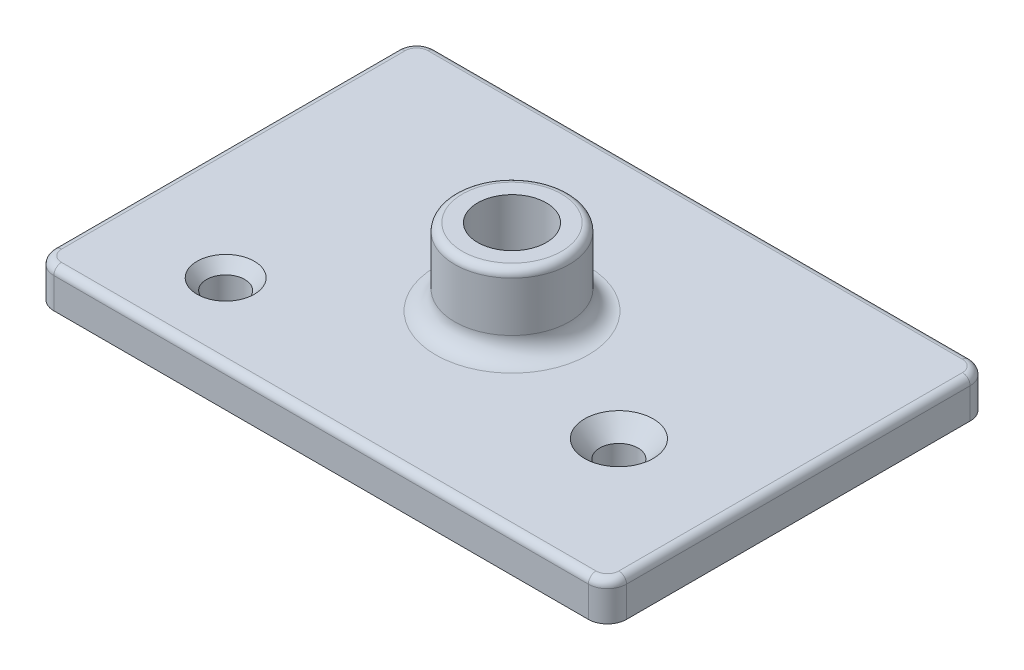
ISO-10303-21;
HEADER;
FILE_DESCRIPTION(('STEP AP214'),'2;1');
FILE_NAME('part.step','',(''),(''),'','','');
FILE_SCHEMA(('AUTOMOTIVE_DESIGN { 1 0 10303 214 1 1 1 1 }'));
ENDSEC;
DATA;
#1=APPLICATION_CONTEXT('core data for automotive mechanical design processes');
#2=APPLICATION_PROTOCOL_DEFINITION('international standard','automotive_design',2000,#1);
#3=PRODUCT_CONTEXT('',#1,'mechanical');
#4=PRODUCT('Part','Part','',(#3));
#5=PRODUCT_RELATED_PRODUCT_CATEGORY('part','',(#4));
#6=PRODUCT_DEFINITION_FORMATION('','',#4);
#7=PRODUCT_DEFINITION_CONTEXT('part definition',#1,'design');
#8=PRODUCT_DEFINITION('design','',#6,#7);
#9=PRODUCT_DEFINITION_SHAPE('','',#8);
#10=(LENGTH_UNIT() NAMED_UNIT(*) SI_UNIT(.MILLI.,.METRE.));
#11=(NAMED_UNIT(*) PLANE_ANGLE_UNIT() SI_UNIT($,.RADIAN.));
#12=(NAMED_UNIT(*) SI_UNIT($,.STERADIAN.) SOLID_ANGLE_UNIT());
#13=UNCERTAINTY_MEASURE_WITH_UNIT(LENGTH_MEASURE(1.E-05),#10,'distance_accuracy_value','');
#14=(GEOMETRIC_REPRESENTATION_CONTEXT(3) GLOBAL_UNCERTAINTY_ASSIGNED_CONTEXT((#13)) GLOBAL_UNIT_ASSIGNED_CONTEXT((#10,
#11,#12)) REPRESENTATION_CONTEXT('',''));
#15=CARTESIAN_POINT('',(0.,0.,0.));
#16=DIRECTION('',(0.,0.,1.));
#17=DIRECTION('',(1.,0.,0.));
#18=AXIS2_PLACEMENT_3D('',#15,#16,#17);
#19=CARTESIAN_POINT('',(-75.,10.,-50.));
#20=DIRECTION('',(0.,1.,0.));
#21=DIRECTION('',(0.,0.,1.));
#22=AXIS2_PLACEMENT_3D('',#19,#20,#21);
#23=PLANE('',#22);
#24=CARTESIAN_POINT('',(70.,10.,-45.));
#25=DIRECTION('',(0.,1.,0.));
#26=DIRECTION('',(0.,0.,1.));
#27=AXIS2_PLACEMENT_3D('',#24,#25,#26);
#28=CIRCLE('',#27,3.);
#29=CARTESIAN_POINT('',(73.,10.,-45.));
#30=VERTEX_POINT('',#29);
#31=CARTESIAN_POINT('',(70.,10.,-48.));
#32=VERTEX_POINT('',#31);
#33=EDGE_CURVE('E177',#30,#32,#28,.T.);
#34=ORIENTED_EDGE('',*,*,#33,.T.);
#35=DIRECTION('',(1.,0.,0.));
#36=VECTOR('',#35,1.);
#37=CARTESIAN_POINT('',(-75.,10.,-48.));
#38=LINE('',#37,#36);
#39=CARTESIAN_POINT('',(-70.,10.,-48.));
#40=VERTEX_POINT('',#39);
#41=EDGE_CURVE('E179',#32,#40,#38,.F.);
#42=ORIENTED_EDGE('',*,*,#41,.T.);
#43=CARTESIAN_POINT('',(-70.,10.,-45.));
#44=DIRECTION('',(0.,1.,0.));
#45=DIRECTION('',(0.,0.,1.));
#46=AXIS2_PLACEMENT_3D('',#43,#44,#45);
#47=CIRCLE('',#46,3.);
#48=CARTESIAN_POINT('',(-73.,10.,-45.));
#49=VERTEX_POINT('',#48);
#50=EDGE_CURVE('E175',#40,#49,#47,.T.);
#51=ORIENTED_EDGE('',*,*,#50,.T.);
#52=DIRECTION('',(0.,0.,1.));
#53=VECTOR('',#52,1.);
#54=CARTESIAN_POINT('',(-73.,10.,45.));
#55=LINE('',#54,#53);
#56=CARTESIAN_POINT('',(-73.,10.,45.));
#57=VERTEX_POINT('',#56);
#58=EDGE_CURVE('E171',#49,#57,#55,.T.);
#59=ORIENTED_EDGE('',*,*,#58,.T.);
#60=CARTESIAN_POINT('',(-70.,10.,45.));
#61=DIRECTION('',(0.,1.,0.));
#62=DIRECTION('',(0.,0.,1.));
#63=AXIS2_PLACEMENT_3D('',#60,#61,#62);
#64=CIRCLE('',#63,3.);
#65=CARTESIAN_POINT('',(-70.,10.,48.));
#66=VERTEX_POINT('',#65);
#67=EDGE_CURVE('E167',#57,#66,#64,.T.);
#68=ORIENTED_EDGE('',*,*,#67,.T.);
#69=DIRECTION('',(-1.,0.,0.));
#70=VECTOR('',#69,1.);
#71=CARTESIAN_POINT('',(-75.,10.,48.));
#72=LINE('',#71,#70);
#73=CARTESIAN_POINT('',(70.,10.,48.));
#74=VERTEX_POINT('',#73);
#75=EDGE_CURVE('E165',#66,#74,#72,.F.);
#76=ORIENTED_EDGE('',*,*,#75,.T.);
#77=CARTESIAN_POINT('',(70.,10.,45.));
#78=DIRECTION('',(0.,1.,0.));
#79=DIRECTION('',(0.,0.,1.));
#80=AXIS2_PLACEMENT_3D('',#77,#78,#79);
#81=CIRCLE('',#80,3.);
#82=CARTESIAN_POINT('',(73.,10.,45.));
#83=VERTEX_POINT('',#82);
#84=EDGE_CURVE('E169',#74,#83,#81,.T.);
#85=ORIENTED_EDGE('',*,*,#84,.T.);
#86=DIRECTION('',(0.,0.,-1.));
#87=VECTOR('',#86,1.);
#88=CARTESIAN_POINT('',(73.,10.,-45.));
#89=LINE('',#88,#87);
#90=EDGE_CURVE('E173',#83,#30,#89,.T.);
#91=ORIENTED_EDGE('',*,*,#90,.T.);
#92=EDGE_LOOP('',(#34,#42,#51,#59,#68,#76,#85,#91));
#93=FACE_BOUND('',#92,.T.);
#94=CARTESIAN_POINT('',(0.,10.,0.));
#95=DIRECTION('',(0.,1.,0.));
#96=DIRECTION('',(0.,0.,1.));
#97=AXIS2_PLACEMENT_3D('',#94,#95,#96);
#98=CIRCLE('',#97,20.);
#99=CARTESIAN_POINT('',(0.,10.,20.));
#100=VERTEX_POINT('',#99);
#101=EDGE_CURVE('E134',#100,#100,#98,.F.);
#102=ORIENTED_EDGE('',*,*,#101,.T.);
#103=EDGE_LOOP('',(#102));
#104=FACE_BOUND('',#103,.T.);
#105=CARTESIAN_POINT('',(-45.,10.,30.));
#106=DIRECTION('',(0.,1.,0.));
#107=DIRECTION('',(0.,0.,1.));
#108=AXIS2_PLACEMENT_3D('',#105,#106,#107);
#109=CIRCLE('',#108,7.5);
#110=CARTESIAN_POINT('',(-45.,10.,37.5));
#111=VERTEX_POINT('',#110);
#112=EDGE_CURVE('E332',#111,#111,#109,.T.);
#113=ORIENTED_EDGE('',*,*,#112,.F.);
#114=EDGE_LOOP('',(#113));
#115=FACE_BOUND('',#114,.T.);
#116=CARTESIAN_POINT('',(43.,9.99999999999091,15.));
#117=DIRECTION('',(0.,1.,0.));
#118=DIRECTION('',(0.,0.,1.));
#119=AXIS2_PLACEMENT_3D('',#116,#117,#118);
#120=CIRCLE('',#119,9.);
#121=CARTESIAN_POINT('',(43.,9.99999999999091,24.));
#122=VERTEX_POINT('',#121);
#123=EDGE_CURVE('E320',#122,#122,#120,.T.);
#124=ORIENTED_EDGE('',*,*,#123,.F.);
#125=EDGE_LOOP('',(#124));
#126=FACE_BOUND('',#125,.T.);
#127=ADVANCED_FACE('F28',(#93,#104,#115,#126),#23,.T.);
#128=CARTESIAN_POINT('',(-75.,0.,-50.));
#129=DIRECTION('',(0.,1.,0.));
#130=DIRECTION('',(0.,0.,1.));
#131=AXIS2_PLACEMENT_3D('',#128,#129,#130);
#132=PLANE('',#131);
#133=CARTESIAN_POINT('',(-45.,0.,30.));
#134=DIRECTION('',(0.,1.,0.));
#135=DIRECTION('',(0.,0.,1.));
#136=AXIS2_PLACEMENT_3D('',#133,#134,#135);
#137=CIRCLE('',#136,5.);
#138=CARTESIAN_POINT('',(-45.,0.,35.));
#139=VERTEX_POINT('',#138);
#140=EDGE_CURVE('E218',#139,#139,#137,.T.);
#141=ORIENTED_EDGE('',*,*,#140,.T.);
#142=EDGE_LOOP('',(#141));
#143=FACE_BOUND('',#142,.T.);
#144=DIRECTION('',(-1.,0.,0.));
#145=VECTOR('',#144,1.);
#146=CARTESIAN_POINT('',(75.,0.,50.));
#147=LINE('',#146,#145);
#148=CARTESIAN_POINT('',(70.,0.,50.));
#149=VERTEX_POINT('',#148);
#150=CARTESIAN_POINT('',(-70.,0.,50.));
#151=VERTEX_POINT('',#150);
#152=EDGE_CURVE('E122',#149,#151,#147,.T.);
#153=ORIENTED_EDGE('',*,*,#152,.T.);
#154=CARTESIAN_POINT('',(-70.,0.,45.));
#155=DIRECTION('',(0.,1.,0.));
#156=DIRECTION('',(0.,0.,1.));
#157=AXIS2_PLACEMENT_3D('',#154,#155,#156);
#158=CIRCLE('',#157,5.);
#159=CARTESIAN_POINT('',(-75.,0.,45.));
#160=VERTEX_POINT('',#159);
#161=EDGE_CURVE('E145',#151,#160,#158,.F.);
#162=ORIENTED_EDGE('',*,*,#161,.T.);
#163=DIRECTION('',(0.,0.,1.));
#164=VECTOR('',#163,1.);
#165=CARTESIAN_POINT('',(-75.,0.,-50.));
#166=LINE('',#165,#164);
#167=CARTESIAN_POINT('',(-75.,0.,-45.));
#168=VERTEX_POINT('',#167);
#169=EDGE_CURVE('E131',#168,#160,#166,.T.);
#170=ORIENTED_EDGE('',*,*,#169,.F.);
#171=CARTESIAN_POINT('',(-70.,0.,-45.));
#172=DIRECTION('',(0.,1.,0.));
#173=DIRECTION('',(0.,0.,1.));
#174=AXIS2_PLACEMENT_3D('',#171,#172,#173);
#175=CIRCLE('',#174,5.);
#176=CARTESIAN_POINT('',(-70.,0.,-50.));
#177=VERTEX_POINT('',#176);
#178=EDGE_CURVE('E143',#168,#177,#175,.F.);
#179=ORIENTED_EDGE('',*,*,#178,.T.);
#180=DIRECTION('',(1.,0.,0.));
#181=VECTOR('',#180,1.);
#182=CARTESIAN_POINT('',(-75.,0.,-50.));
#183=LINE('',#182,#181);
#184=CARTESIAN_POINT('',(70.,0.,-50.));
#185=VERTEX_POINT('',#184);
#186=EDGE_CURVE('E230',#177,#185,#183,.T.);
#187=ORIENTED_EDGE('',*,*,#186,.T.);
#188=CARTESIAN_POINT('',(70.,0.,-45.));
#189=DIRECTION('',(0.,1.,0.));
#190=DIRECTION('',(0.,0.,1.));
#191=AXIS2_PLACEMENT_3D('',#188,#189,#190);
#192=CIRCLE('',#191,5.);
#193=CARTESIAN_POINT('',(75.,0.,-45.));
#194=VERTEX_POINT('',#193);
#195=EDGE_CURVE('E125',#185,#194,#192,.F.);
#196=ORIENTED_EDGE('',*,*,#195,.T.);
#197=DIRECTION('',(0.,0.,-1.));
#198=VECTOR('',#197,1.);
#199=CARTESIAN_POINT('',(75.,0.,50.));
#200=LINE('',#199,#198);
#201=CARTESIAN_POINT('',(75.,0.,45.));
#202=VERTEX_POINT('',#201);
#203=EDGE_CURVE('E124',#202,#194,#200,.T.);
#204=ORIENTED_EDGE('',*,*,#203,.F.);
#205=CARTESIAN_POINT('',(70.,0.,45.));
#206=DIRECTION('',(0.,1.,0.));
#207=DIRECTION('',(0.,0.,1.));
#208=AXIS2_PLACEMENT_3D('',#205,#206,#207);
#209=CIRCLE('',#208,5.);
#210=EDGE_CURVE('E118',#202,#149,#209,.F.);
#211=ORIENTED_EDGE('',*,*,#210,.T.);
#212=EDGE_LOOP('',(#153,#162,#170,#179,#187,#196,#204,#211));
#213=FACE_BOUND('',#212,.T.);
#214=CARTESIAN_POINT('',(43.,0.,15.));
#215=DIRECTION('',(0.,1.,0.));
#216=DIRECTION('',(0.,0.,1.));
#217=AXIS2_PLACEMENT_3D('',#214,#215,#216);
#218=CIRCLE('',#217,5.);
#219=CARTESIAN_POINT('',(43.,0.,20.));
#220=VERTEX_POINT('',#219);
#221=EDGE_CURVE('E329',#220,#220,#218,.T.);
#222=ORIENTED_EDGE('',*,*,#221,.T.);
#223=EDGE_LOOP('',(#222));
#224=FACE_BOUND('',#223,.T.);
#225=ADVANCED_FACE('F120',(#143,#213,#224),#132,.F.);
#226=CARTESIAN_POINT('',(-75.,10.,-50.));
#227=DIRECTION('',(1.,0.,0.));
#228=DIRECTION('',(0.,0.,-1.));
#229=AXIS2_PLACEMENT_3D('',#226,#227,#228);
#230=PLANE('',#229);
#231=DIRECTION('',(0.,-1.,0.));
#232=VECTOR('',#231,1.);
#233=CARTESIAN_POINT('',(-75.,10.,45.));
#234=LINE('',#233,#232);
#235=CARTESIAN_POINT('',(-75.,8.,45.));
#236=VERTEX_POINT('',#235);
#237=EDGE_CURVE('E149',#160,#236,#234,.F.);
#238=ORIENTED_EDGE('',*,*,#237,.T.);
#239=DIRECTION('',(0.,0.,1.));
#240=VECTOR('',#239,1.);
#241=CARTESIAN_POINT('',(-75.,8.,-45.));
#242=LINE('',#241,#240);
#243=CARTESIAN_POINT('',(-75.,8.,-45.));
#244=VERTEX_POINT('',#243);
#245=EDGE_CURVE('E188',#236,#244,#242,.F.);
#246=ORIENTED_EDGE('',*,*,#245,.T.);
#247=DIRECTION('',(0.,-1.,0.));
#248=VECTOR('',#247,1.);
#249=CARTESIAN_POINT('',(-75.,0.,-45.));
#250=LINE('',#249,#248);
#251=EDGE_CURVE('E147',#244,#168,#250,.T.);
#252=ORIENTED_EDGE('',*,*,#251,.T.);
#253=ORIENTED_EDGE('',*,*,#169,.T.);
#254=EDGE_LOOP('',(#238,#246,#252,#253));
#255=FACE_BOUND('',#254,.T.);
#256=ADVANCED_FACE('F30',(#255),#230,.F.);
#257=CARTESIAN_POINT('',(75.,10.,50.));
#258=DIRECTION('',(0.,0.,1.));
#259=DIRECTION('',(1.,0.,0.));
#260=AXIS2_PLACEMENT_3D('',#257,#258,#259);
#261=PLANE('',#260);
#262=DIRECTION('',(0.,-1.,0.));
#263=VECTOR('',#262,1.);
#264=CARTESIAN_POINT('',(70.,10.,50.));
#265=LINE('',#264,#263);
#266=CARTESIAN_POINT('',(70.,8.,50.));
#267=VERTEX_POINT('',#266);
#268=EDGE_CURVE('E129',#149,#267,#265,.F.);
#269=ORIENTED_EDGE('',*,*,#268,.T.);
#270=DIRECTION('',(-1.,0.,0.));
#271=VECTOR('',#270,1.);
#272=CARTESIAN_POINT('',(75.,8.,50.));
#273=LINE('',#272,#271);
#274=CARTESIAN_POINT('',(-70.,8.,50.));
#275=VERTEX_POINT('',#274);
#276=EDGE_CURVE('E11',#267,#275,#273,.T.);
#277=ORIENTED_EDGE('',*,*,#276,.T.);
#278=DIRECTION('',(0.,-1.,0.));
#279=VECTOR('',#278,1.);
#280=CARTESIAN_POINT('',(-70.,0.,50.));
#281=LINE('',#280,#279);
#282=EDGE_CURVE('E126',#275,#151,#281,.T.);
#283=ORIENTED_EDGE('',*,*,#282,.T.);
#284=ORIENTED_EDGE('',*,*,#152,.F.);
#285=EDGE_LOOP('',(#269,#277,#283,#284));
#286=FACE_BOUND('',#285,.T.);
#287=ADVANCED_FACE('F128',(#286),#261,.T.);
#288=CARTESIAN_POINT('',(75.,10.,50.));
#289=DIRECTION('',(-1.,0.,0.));
#290=DIRECTION('',(0.,0.,1.));
#291=AXIS2_PLACEMENT_3D('',#288,#289,#290);
#292=PLANE('',#291);
#293=DIRECTION('',(0.,-1.,0.));
#294=VECTOR('',#293,1.);
#295=CARTESIAN_POINT('',(75.,10.,-45.));
#296=LINE('',#295,#294);
#297=CARTESIAN_POINT('',(75.,8.,-45.));
#298=VERTEX_POINT('',#297);
#299=EDGE_CURVE('E159',#194,#298,#296,.F.);
#300=ORIENTED_EDGE('',*,*,#299,.T.);
#301=DIRECTION('',(0.,0.,-1.));
#302=VECTOR('',#301,1.);
#303=CARTESIAN_POINT('',(75.,8.,45.));
#304=LINE('',#303,#302);
#305=CARTESIAN_POINT('',(75.,8.,45.));
#306=VERTEX_POINT('',#305);
#307=EDGE_CURVE('E186',#298,#306,#304,.F.);
#308=ORIENTED_EDGE('',*,*,#307,.T.);
#309=DIRECTION('',(0.,-1.,0.));
#310=VECTOR('',#309,1.);
#311=CARTESIAN_POINT('',(75.,0.,45.));
#312=LINE('',#311,#310);
#313=EDGE_CURVE('E157',#306,#202,#312,.T.);
#314=ORIENTED_EDGE('',*,*,#313,.T.);
#315=ORIENTED_EDGE('',*,*,#203,.T.);
#316=EDGE_LOOP('',(#300,#308,#314,#315));
#317=FACE_BOUND('',#316,.T.);
#318=ADVANCED_FACE('F267',(#317),#292,.F.);
#319=CARTESIAN_POINT('',(-75.,10.,-50.));
#320=DIRECTION('',(0.,0.,-1.));
#321=DIRECTION('',(-1.,0.,0.));
#322=AXIS2_PLACEMENT_3D('',#319,#320,#321);
#323=PLANE('',#322);
#324=DIRECTION('',(0.,-1.,0.));
#325=VECTOR('',#324,1.);
#326=CARTESIAN_POINT('',(-70.,10.,-50.));
#327=LINE('',#326,#325);
#328=CARTESIAN_POINT('',(-70.,8.,-50.));
#329=VERTEX_POINT('',#328);
#330=EDGE_CURVE('E154',#177,#329,#327,.F.);
#331=ORIENTED_EDGE('',*,*,#330,.T.);
#332=DIRECTION('',(1.,0.,0.));
#333=VECTOR('',#332,1.);
#334=CARTESIAN_POINT('',(-75.,8.,-50.));
#335=LINE('',#334,#333);
#336=CARTESIAN_POINT('',(70.,8.,-50.));
#337=VERTEX_POINT('',#336);
#338=EDGE_CURVE('E162',#329,#337,#335,.T.);
#339=ORIENTED_EDGE('',*,*,#338,.T.);
#340=DIRECTION('',(0.,-1.,0.));
#341=VECTOR('',#340,1.);
#342=CARTESIAN_POINT('',(70.,0.,-50.));
#343=LINE('',#342,#341);
#344=EDGE_CURVE('E152',#337,#185,#343,.T.);
#345=ORIENTED_EDGE('',*,*,#344,.T.);
#346=ORIENTED_EDGE('',*,*,#186,.F.);
#347=EDGE_LOOP('',(#331,#339,#345,#346));
#348=FACE_BOUND('',#347,.T.);
#349=ADVANCED_FACE('F264',(#348),#323,.T.);
#350=CARTESIAN_POINT('',(0.,30.,0.));
#351=DIRECTION('',(0.,-1.,0.));
#352=DIRECTION('',(0.,0.,-1.));
#353=AXIS2_PLACEMENT_3D('',#350,#351,#352);
#354=CYLINDRICAL_SURFACE('',#353,15.);
#355=CARTESIAN_POINT('',(0.,28.,0.));
#356=DIRECTION('',(0.,1.,0.));
#357=DIRECTION('',(0.,0.,1.));
#358=AXIS2_PLACEMENT_3D('',#355,#356,#357);
#359=CIRCLE('',#358,15.);
#360=CARTESIAN_POINT('',(0.,28.,15.));
#361=VERTEX_POINT('',#360);
#362=EDGE_CURVE('E36',#361,#361,#359,.F.);
#363=ORIENTED_EDGE('',*,*,#362,.T.);
#364=EDGE_LOOP('',(#363));
#365=FACE_BOUND('',#364,.T.);
#366=CARTESIAN_POINT('',(0.,15.,0.));
#367=DIRECTION('',(0.,1.,0.));
#368=DIRECTION('',(0.,0.,1.));
#369=AXIS2_PLACEMENT_3D('',#366,#367,#368);
#370=CIRCLE('',#369,15.);
#371=CARTESIAN_POINT('',(0.,15.,15.));
#372=VERTEX_POINT('',#371);
#373=EDGE_CURVE('E138',#372,#372,#370,.T.);
#374=ORIENTED_EDGE('',*,*,#373,.T.);
#375=EDGE_LOOP('',(#374));
#376=FACE_BOUND('',#375,.T.);
#377=ADVANCED_FACE('F198',(#365,#376),#354,.T.);
#378=CARTESIAN_POINT('',(0.,30.,0.));
#379=DIRECTION('',(0.,1.,0.));
#380=DIRECTION('',(0.,0.,1.));
#381=AXIS2_PLACEMENT_3D('',#378,#379,#380);
#382=PLANE('',#381);
#383=CARTESIAN_POINT('',(0.,30.,0.));
#384=DIRECTION('',(0.,1.,0.));
#385=DIRECTION('',(0.,0.,1.));
#386=AXIS2_PLACEMENT_3D('',#383,#384,#385);
#387=CIRCLE('',#386,13.);
#388=CARTESIAN_POINT('',(0.,30.,13.));
#389=VERTEX_POINT('',#388);
#390=EDGE_CURVE('E193',#389,#389,#387,.T.);
#391=ORIENTED_EDGE('',*,*,#390,.T.);
#392=EDGE_LOOP('',(#391));
#393=FACE_BOUND('',#392,.T.);
#394=CARTESIAN_POINT('',(0.,30.,0.));
#395=DIRECTION('',(0.,1.,0.));
#396=DIRECTION('',(0.,0.,1.));
#397=AXIS2_PLACEMENT_3D('',#394,#395,#396);
#398=CIRCLE('',#397,9.);
#399=CARTESIAN_POINT('',(0.,30.,9.));
#400=VERTEX_POINT('',#399);
#401=EDGE_CURVE('E215',#400,#400,#398,.T.);
#402=ORIENTED_EDGE('',*,*,#401,.F.);
#403=EDGE_LOOP('',(#402));
#404=FACE_BOUND('',#403,.T.);
#405=ADVANCED_FACE('F208',(#393,#404),#382,.T.);
#406=CARTESIAN_POINT('',(0.,5.,0.));
#407=DIRECTION('',(0.,1.,0.));
#408=DIRECTION('',(0.,0.,1.));
#409=AXIS2_PLACEMENT_3D('',#406,#407,#408);
#410=CYLINDRICAL_SURFACE('',#409,9.);
#411=CARTESIAN_POINT('',(0.,5.,0.));
#412=DIRECTION('',(0.,1.,0.));
#413=DIRECTION('',(0.,0.,1.));
#414=AXIS2_PLACEMENT_3D('',#411,#412,#413);
#415=CIRCLE('',#414,9.);
#416=CARTESIAN_POINT('',(0.,5.,9.));
#417=VERTEX_POINT('',#416);
#418=EDGE_CURVE('E217',#417,#417,#415,.T.);
#419=ORIENTED_EDGE('',*,*,#418,.F.);
#420=EDGE_LOOP('',(#419));
#421=FACE_BOUND('',#420,.T.);
#422=ORIENTED_EDGE('',*,*,#401,.T.);
#423=EDGE_LOOP('',(#422));
#424=FACE_BOUND('',#423,.T.);
#425=ADVANCED_FACE('F211',(#421,#424),#410,.F.);
#426=CARTESIAN_POINT('',(0.,5.,0.));
#427=DIRECTION('',(0.,1.,0.));
#428=DIRECTION('',(0.,0.,1.));
#429=AXIS2_PLACEMENT_3D('',#426,#427,#428);
#430=PLANE('',#429);
#431=ORIENTED_EDGE('',*,*,#418,.T.);
#432=EDGE_LOOP('',(#431));
#433=FACE_BOUND('',#432,.T.);
#434=ADVANCED_FACE('F350',(#433),#430,.T.);
#435=CARTESIAN_POINT('',(-45.,10.,30.));
#436=DIRECTION('',(0.,1.,0.));
#437=DIRECTION('',(0.,0.,1.));
#438=AXIS2_PLACEMENT_3D('',#435,#436,#437);
#439=CYLINDRICAL_SURFACE('',#438,5.);
#440=CARTESIAN_POINT('',(-45.,7.12407898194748,30.));
#441=DIRECTION('',(0.,1.,0.));
#442=DIRECTION('',(0.,0.,1.));
#443=AXIS2_PLACEMENT_3D('',#440,#441,#442);
#444=CIRCLE('',#443,5.);
#445=CARTESIAN_POINT('',(-45.,7.12407898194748,35.));
#446=VERTEX_POINT('',#445);
#447=EDGE_CURVE('E223',#446,#446,#444,.T.);
#448=ORIENTED_EDGE('',*,*,#447,.T.);
#449=EDGE_LOOP('',(#448));
#450=FACE_BOUND('',#449,.T.);
#451=ORIENTED_EDGE('',*,*,#140,.F.);
#452=EDGE_LOOP('',(#451));
#453=FACE_BOUND('',#452,.T.);
#454=ADVANCED_FACE('F337',(#450,#453),#439,.F.);
#455=CARTESIAN_POINT('',(-45.,7.12407898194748,30.));
#456=DIRECTION('',(0.,1.,0.));
#457=DIRECTION('',(0.,0.,1.));
#458=AXIS2_PLACEMENT_3D('',#455,#456,#457);
#459=CONICAL_SURFACE('',#458,5.,0.715584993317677);
#460=ORIENTED_EDGE('',*,*,#112,.T.);
#461=EDGE_LOOP('',(#460));
#462=FACE_BOUND('',#461,.T.);
#463=ORIENTED_EDGE('',*,*,#447,.F.);
#464=EDGE_LOOP('',(#463));
#465=FACE_BOUND('',#464,.T.);
#466=ADVANCED_FACE('F340',(#462,#465),#459,.F.);
#467=CARTESIAN_POINT('',(43.,9.99999999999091,15.));
#468=DIRECTION('',(0.,1.,0.));
#469=DIRECTION('',(0.,0.,1.));
#470=AXIS2_PLACEMENT_3D('',#467,#468,#469);
#471=CYLINDRICAL_SURFACE('',#470,5.);
#472=CARTESIAN_POINT('',(43.,5.39852637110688,15.));
#473=DIRECTION('',(0.,1.,0.));
#474=DIRECTION('',(0.,0.,1.));
#475=AXIS2_PLACEMENT_3D('',#472,#473,#474);
#476=CIRCLE('',#475,5.);
#477=CARTESIAN_POINT('',(43.,5.39852637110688,20.));
#478=VERTEX_POINT('',#477);
#479=EDGE_CURVE('E323',#478,#478,#476,.T.);
#480=ORIENTED_EDGE('',*,*,#479,.T.);
#481=EDGE_LOOP('',(#480));
#482=FACE_BOUND('',#481,.T.);
#483=ORIENTED_EDGE('',*,*,#221,.F.);
#484=EDGE_LOOP('',(#483));
#485=FACE_BOUND('',#484,.T.);
#486=ADVANCED_FACE('F250',(#482,#485),#471,.F.);
#487=CARTESIAN_POINT('',(43.,5.39852637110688,15.));
#488=DIRECTION('',(0.,1.,0.));
#489=DIRECTION('',(0.,0.,1.));
#490=AXIS2_PLACEMENT_3D('',#487,#488,#489);
#491=CONICAL_SURFACE('',#490,5.,0.715584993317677);
#492=ORIENTED_EDGE('',*,*,#123,.T.);
#493=EDGE_LOOP('',(#492));
#494=FACE_BOUND('',#493,.T.);
#495=ORIENTED_EDGE('',*,*,#479,.F.);
#496=EDGE_LOOP('',(#495));
#497=FACE_BOUND('',#496,.T.);
#498=ADVANCED_FACE('F238',(#494,#497),#491,.F.);
#499=CARTESIAN_POINT('',(0.,15.,0.));
#500=DIRECTION('',(0.,1.,0.));
#501=DIRECTION('',(0.,0.,1.));
#502=AXIS2_PLACEMENT_3D('',#499,#500,#501);
#503=TOROIDAL_SURFACE('',#502,20.,5.);
#504=ORIENTED_EDGE('',*,*,#101,.F.);
#505=EDGE_LOOP('',(#504));
#506=FACE_BOUND('',#505,.T.);
#507=ORIENTED_EDGE('',*,*,#373,.F.);
#508=EDGE_LOOP('',(#507));
#509=FACE_BOUND('',#508,.T.);
#510=ADVANCED_FACE('F235',(#506,#509),#503,.F.);
#511=CARTESIAN_POINT('',(-70.,10.,45.));
#512=DIRECTION('',(0.,1.,0.));
#513=DIRECTION('',(0.,0.,1.));
#514=AXIS2_PLACEMENT_3D('',#511,#512,#513);
#515=CYLINDRICAL_SURFACE('',#514,5.);
#516=ORIENTED_EDGE('',*,*,#282,.F.);
#517=CARTESIAN_POINT('',(-70.,8.,45.));
#518=DIRECTION('',(0.,1.,0.));
#519=DIRECTION('',(0.,0.,1.));
#520=AXIS2_PLACEMENT_3D('',#517,#518,#519);
#521=CIRCLE('',#520,5.);
#522=EDGE_CURVE('E191',#275,#236,#521,.F.);
#523=ORIENTED_EDGE('',*,*,#522,.T.);
#524=ORIENTED_EDGE('',*,*,#237,.F.);
#525=ORIENTED_EDGE('',*,*,#161,.F.);
#526=EDGE_LOOP('',(#516,#523,#524,#525));
#527=FACE_BOUND('',#526,.T.);
#528=ADVANCED_FACE('F237',(#527),#515,.T.);
#529=CARTESIAN_POINT('',(-70.,10.,-45.));
#530=DIRECTION('',(0.,1.,0.));
#531=DIRECTION('',(0.,0.,1.));
#532=AXIS2_PLACEMENT_3D('',#529,#530,#531);
#533=CYLINDRICAL_SURFACE('',#532,5.);
#534=ORIENTED_EDGE('',*,*,#251,.F.);
#535=CARTESIAN_POINT('',(-70.,8.,-45.));
#536=DIRECTION('',(0.,1.,0.));
#537=DIRECTION('',(0.,0.,1.));
#538=AXIS2_PLACEMENT_3D('',#535,#536,#537);
#539=CIRCLE('',#538,5.);
#540=EDGE_CURVE('E184',#244,#329,#539,.F.);
#541=ORIENTED_EDGE('',*,*,#540,.T.);
#542=ORIENTED_EDGE('',*,*,#330,.F.);
#543=ORIENTED_EDGE('',*,*,#178,.F.);
#544=EDGE_LOOP('',(#534,#541,#542,#543));
#545=FACE_BOUND('',#544,.T.);
#546=ADVANCED_FACE('F246',(#545),#533,.T.);
#547=CARTESIAN_POINT('',(70.,10.,-45.));
#548=DIRECTION('',(0.,1.,0.));
#549=DIRECTION('',(0.,0.,1.));
#550=AXIS2_PLACEMENT_3D('',#547,#548,#549);
#551=CYLINDRICAL_SURFACE('',#550,5.);
#552=ORIENTED_EDGE('',*,*,#344,.F.);
#553=CARTESIAN_POINT('',(70.,8.,-45.));
#554=DIRECTION('',(0.,1.,0.));
#555=DIRECTION('',(0.,0.,1.));
#556=AXIS2_PLACEMENT_3D('',#553,#554,#555);
#557=CIRCLE('',#556,5.);
#558=EDGE_CURVE('E182',#337,#298,#557,.F.);
#559=ORIENTED_EDGE('',*,*,#558,.T.);
#560=ORIENTED_EDGE('',*,*,#299,.F.);
#561=ORIENTED_EDGE('',*,*,#195,.F.);
#562=EDGE_LOOP('',(#552,#559,#560,#561));
#563=FACE_BOUND('',#562,.T.);
#564=ADVANCED_FACE('F378',(#563),#551,.T.);
#565=CARTESIAN_POINT('',(70.,10.,45.));
#566=DIRECTION('',(0.,1.,0.));
#567=DIRECTION('',(0.,0.,1.));
#568=AXIS2_PLACEMENT_3D('',#565,#566,#567);
#569=CYLINDRICAL_SURFACE('',#568,5.);
#570=ORIENTED_EDGE('',*,*,#313,.F.);
#571=CARTESIAN_POINT('',(70.,8.,45.));
#572=DIRECTION('',(0.,1.,0.));
#573=DIRECTION('',(0.,0.,1.));
#574=AXIS2_PLACEMENT_3D('',#571,#572,#573);
#575=CIRCLE('',#574,5.);
#576=EDGE_CURVE('E49',#306,#267,#575,.F.);
#577=ORIENTED_EDGE('',*,*,#576,.T.);
#578=ORIENTED_EDGE('',*,*,#268,.F.);
#579=ORIENTED_EDGE('',*,*,#210,.F.);
#580=EDGE_LOOP('',(#570,#577,#578,#579));
#581=FACE_BOUND('',#580,.T.);
#582=ADVANCED_FACE('F133',(#581),#569,.T.);
#583=CARTESIAN_POINT('',(75.,8.,48.));
#584=DIRECTION('',(-1.,0.,0.));
#585=DIRECTION('',(0.,0.,1.));
#586=AXIS2_PLACEMENT_3D('',#583,#584,#585);
#587=CYLINDRICAL_SURFACE('',#586,2.);
#588=CARTESIAN_POINT('',(70.,8.,48.));
#589=DIRECTION('',(1.,0.,0.));
#590=DIRECTION('',(0.,0.,-1.));
#591=AXIS2_PLACEMENT_3D('',#588,#589,#590);
#592=CIRCLE('',#591,2.);
#593=EDGE_CURVE('E291',#74,#267,#592,.T.);
#594=ORIENTED_EDGE('',*,*,#593,.F.);
#595=ORIENTED_EDGE('',*,*,#75,.F.);
#596=CARTESIAN_POINT('',(-70.,8.,48.));
#597=DIRECTION('',(-1.,0.,0.));
#598=DIRECTION('',(0.,0.,1.));
#599=AXIS2_PLACEMENT_3D('',#596,#597,#598);
#600=CIRCLE('',#599,2.);
#601=EDGE_CURVE('E316',#275,#66,#600,.T.);
#602=ORIENTED_EDGE('',*,*,#601,.F.);
#603=ORIENTED_EDGE('',*,*,#276,.F.);
#604=EDGE_LOOP('',(#594,#595,#602,#603));
#605=FACE_BOUND('',#604,.T.);
#606=ADVANCED_FACE('F318',(#605),#587,.T.);
#607=CARTESIAN_POINT('',(-70.,8.,45.));
#608=DIRECTION('',(0.,1.,0.));
#609=DIRECTION('',(0.,0.,1.));
#610=AXIS2_PLACEMENT_3D('',#607,#608,#609);
#611=TOROIDAL_SURFACE('',#610,3.,2.);
#612=ORIENTED_EDGE('',*,*,#601,.T.);
#613=ORIENTED_EDGE('',*,*,#67,.F.);
#614=CARTESIAN_POINT('',(-73.,8.,45.));
#615=DIRECTION('',(0.,0.,-1.));
#616=DIRECTION('',(-1.,0.,0.));
#617=AXIS2_PLACEMENT_3D('',#614,#615,#616);
#618=CIRCLE('',#617,2.);
#619=EDGE_CURVE('E286',#236,#57,#618,.T.);
#620=ORIENTED_EDGE('',*,*,#619,.F.);
#621=ORIENTED_EDGE('',*,*,#522,.F.);
#622=EDGE_LOOP('',(#612,#613,#620,#621));
#623=FACE_BOUND('',#622,.T.);
#624=ADVANCED_FACE('F288',(#623),#611,.T.);
#625=CARTESIAN_POINT('',(70.,8.,45.));
#626=DIRECTION('',(0.,1.,0.));
#627=DIRECTION('',(0.,0.,1.));
#628=AXIS2_PLACEMENT_3D('',#625,#626,#627);
#629=TOROIDAL_SURFACE('',#628,3.,2.);
#630=ORIENTED_EDGE('',*,*,#593,.T.);
#631=ORIENTED_EDGE('',*,*,#576,.F.);
#632=CARTESIAN_POINT('',(73.,8.,45.));
#633=DIRECTION('',(0.,0.,-1.));
#634=DIRECTION('',(-1.,0.,0.));
#635=AXIS2_PLACEMENT_3D('',#632,#633,#634);
#636=CIRCLE('',#635,2.);
#637=EDGE_CURVE('E292',#83,#306,#636,.T.);
#638=ORIENTED_EDGE('',*,*,#637,.F.);
#639=ORIENTED_EDGE('',*,*,#84,.F.);
#640=EDGE_LOOP('',(#630,#631,#638,#639));
#641=FACE_BOUND('',#640,.T.);
#642=ADVANCED_FACE('F404',(#641),#629,.T.);
#643=CARTESIAN_POINT('',(-73.,8.,-50.));
#644=DIRECTION('',(0.,0.,-1.));
#645=DIRECTION('',(-1.,0.,0.));
#646=AXIS2_PLACEMENT_3D('',#643,#644,#645);
#647=CYLINDRICAL_SURFACE('',#646,2.);
#648=ORIENTED_EDGE('',*,*,#619,.T.);
#649=ORIENTED_EDGE('',*,*,#58,.F.);
#650=CARTESIAN_POINT('',(-73.,8.,-45.));
#651=DIRECTION('',(0.,0.,-1.));
#652=DIRECTION('',(-1.,0.,0.));
#653=AXIS2_PLACEMENT_3D('',#650,#651,#652);
#654=CIRCLE('',#653,2.);
#655=EDGE_CURVE('E297',#244,#49,#654,.T.);
#656=ORIENTED_EDGE('',*,*,#655,.F.);
#657=ORIENTED_EDGE('',*,*,#245,.F.);
#658=EDGE_LOOP('',(#648,#649,#656,#657));
#659=FACE_BOUND('',#658,.T.);
#660=ADVANCED_FACE('F295',(#659),#647,.T.);
#661=CARTESIAN_POINT('',(73.,8.,-50.));
#662=DIRECTION('',(0.,0.,1.));
#663=DIRECTION('',(1.,0.,0.));
#664=AXIS2_PLACEMENT_3D('',#661,#662,#663);
#665=CYLINDRICAL_SURFACE('',#664,2.);
#666=ORIENTED_EDGE('',*,*,#637,.T.);
#667=ORIENTED_EDGE('',*,*,#307,.F.);
#668=CARTESIAN_POINT('',(73.,8.,-45.));
#669=DIRECTION('',(0.,0.,-1.));
#670=DIRECTION('',(-1.,0.,0.));
#671=AXIS2_PLACEMENT_3D('',#668,#669,#670);
#672=CIRCLE('',#671,2.);
#673=EDGE_CURVE('E301',#30,#298,#672,.T.);
#674=ORIENTED_EDGE('',*,*,#673,.F.);
#675=ORIENTED_EDGE('',*,*,#90,.F.);
#676=EDGE_LOOP('',(#666,#667,#674,#675));
#677=FACE_BOUND('',#676,.T.);
#678=ADVANCED_FACE('F418',(#677),#665,.T.);
#679=CARTESIAN_POINT('',(-70.,8.,-45.));
#680=DIRECTION('',(0.,1.,0.));
#681=DIRECTION('',(0.,0.,1.));
#682=AXIS2_PLACEMENT_3D('',#679,#680,#681);
#683=TOROIDAL_SURFACE('',#682,3.,2.);
#684=ORIENTED_EDGE('',*,*,#655,.T.);
#685=ORIENTED_EDGE('',*,*,#50,.F.);
#686=CARTESIAN_POINT('',(-70.,8.,-48.));
#687=DIRECTION('',(1.,0.,0.));
#688=DIRECTION('',(0.,0.,-1.));
#689=AXIS2_PLACEMENT_3D('',#686,#687,#688);
#690=CIRCLE('',#689,2.);
#691=EDGE_CURVE('E305',#329,#40,#690,.T.);
#692=ORIENTED_EDGE('',*,*,#691,.F.);
#693=ORIENTED_EDGE('',*,*,#540,.F.);
#694=EDGE_LOOP('',(#684,#685,#692,#693));
#695=FACE_BOUND('',#694,.T.);
#696=ADVANCED_FACE('F304',(#695),#683,.T.);
#697=CARTESIAN_POINT('',(70.,8.,-45.));
#698=DIRECTION('',(0.,1.,0.));
#699=DIRECTION('',(0.,0.,1.));
#700=AXIS2_PLACEMENT_3D('',#697,#698,#699);
#701=TOROIDAL_SURFACE('',#700,3.,2.);
#702=ORIENTED_EDGE('',*,*,#673,.T.);
#703=ORIENTED_EDGE('',*,*,#558,.F.);
#704=CARTESIAN_POINT('',(70.,8.,-48.));
#705=DIRECTION('',(-1.,0.,0.));
#706=DIRECTION('',(0.,0.,1.));
#707=AXIS2_PLACEMENT_3D('',#704,#705,#706);
#708=CIRCLE('',#707,2.);
#709=EDGE_CURVE('E455',#32,#337,#708,.T.);
#710=ORIENTED_EDGE('',*,*,#709,.F.);
#711=ORIENTED_EDGE('',*,*,#33,.F.);
#712=EDGE_LOOP('',(#702,#703,#710,#711));
#713=FACE_BOUND('',#712,.T.);
#714=ADVANCED_FACE('F432',(#713),#701,.T.);
#715=CARTESIAN_POINT('',(-75.,8.,-48.));
#716=DIRECTION('',(1.,0.,0.));
#717=DIRECTION('',(0.,0.,-1.));
#718=AXIS2_PLACEMENT_3D('',#715,#716,#717);
#719=CYLINDRICAL_SURFACE('',#718,2.);
#720=ORIENTED_EDGE('',*,*,#691,.T.);
#721=ORIENTED_EDGE('',*,*,#41,.F.);
#722=ORIENTED_EDGE('',*,*,#709,.T.);
#723=ORIENTED_EDGE('',*,*,#338,.F.);
#724=EDGE_LOOP('',(#720,#721,#722,#723));
#725=FACE_BOUND('',#724,.T.);
#726=ADVANCED_FACE('F204',(#725),#719,.T.);
#727=CARTESIAN_POINT('',(0.,28.,0.));
#728=DIRECTION('',(0.,1.,0.));
#729=DIRECTION('',(0.,0.,1.));
#730=AXIS2_PLACEMENT_3D('',#727,#728,#729);
#731=TOROIDAL_SURFACE('',#730,13.,2.);
#732=ORIENTED_EDGE('',*,*,#362,.F.);
#733=EDGE_LOOP('',(#732));
#734=FACE_BOUND('',#733,.T.);
#735=ORIENTED_EDGE('',*,*,#390,.F.);
#736=EDGE_LOOP('',(#735));
#737=FACE_BOUND('',#736,.T.);
#738=ADVANCED_FACE('F201',(#734,#737),#731,.T.);
#739=CLOSED_SHELL('',(#127,#225,#256,#287,#318,#349,#377,#405,#425,#434,#454,#466,#486,#498,
#510,#528,#546,#564,#582,#606,#624,#642,#660,#678,#696,#714,#726,#738));
#740=MANIFOLD_SOLID_BREP('B2',#739);
#741=ADVANCED_BREP_SHAPE_REPRESENTATION('',(#18,#740),#14);
#742=SHAPE_DEFINITION_REPRESENTATION(#9,#741);
ENDSEC;
END-ISO-10303-21;
